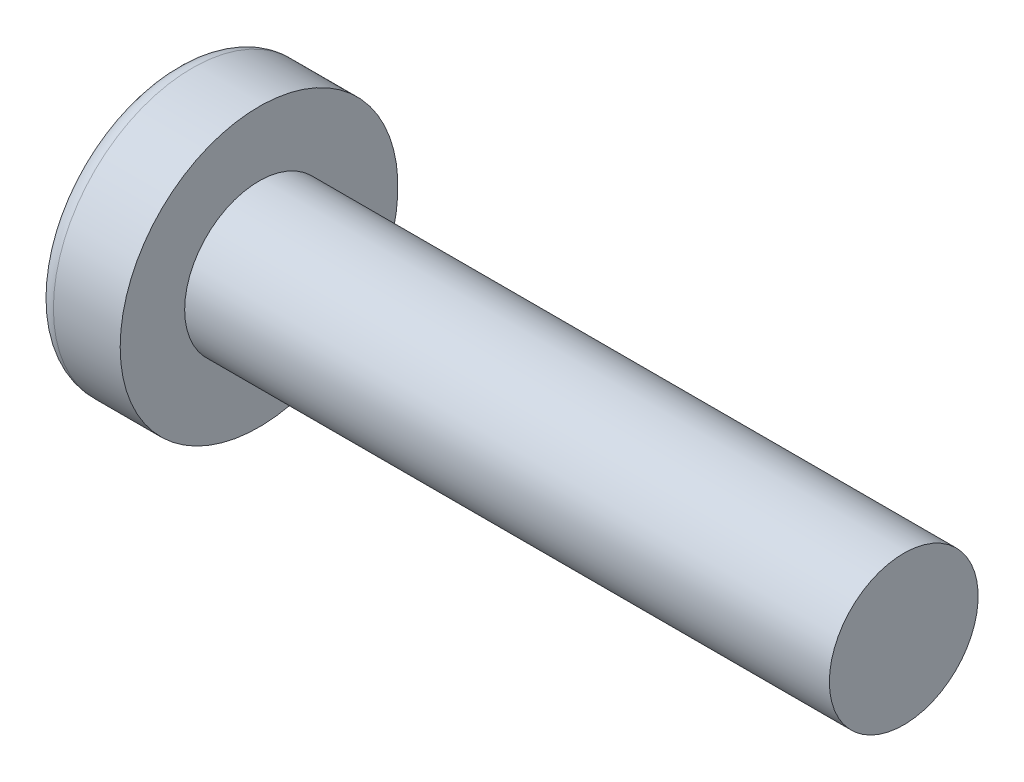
from build123d import *

# Parameters (mm, degrees)
CIRPATTERN1_COUNT = 2
CIRPATTERN1_ANGLE = 90


with BuildPart() as part:
    # BodySke → Base-Revolve (revolve)
    with BuildSketch(Plane.XY, mode=Mode.PRIVATE) as base_revolve_sk:
        with BuildLine():
            Line((2.4, 1.5), (2.4, 2.8))
            Line((2.4, 2.8), (1.053355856, 2.8))
            ThreePointArc((1.053355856, 2.8), (0.878072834, 2.754445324), (0.747150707, 2.629310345))
            ThreePointArc((0.747150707, 2.629310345), (0.190413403, 1.366702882), (0, 0))
            Line((0, 0), (15.4, 0))
            Line((15.4, 0), (15.4, 1.5))
            Line((15.4, 1.5), (2.4, 1.5))
        make_face()
    revolve(base_revolve_sk.sketch.rotate(Axis((-25.4, 0, 0), (1, 0, 0)), 90), axis=Axis((-25.4, 0, 0), (1, 0, 0)))

    # Sketch3 → Cut-Loft1 section 0
    with BuildSketch(Plane(origin=(0, 0, 0), x_dir=(0, 0, -1), z_dir=(1, 0, 0))):
        with BuildLine():
            Line((0.37, -1.45), (-0.37, -1.45))
            Line((-0.37, -1.45), (-0.37, 1.45))
            Line((-0.37, 1.45), (0.37, 1.45))
            Line((0.37, 1.45), (0.37, -1.45))
        make_face()
    # Sketch4 → Cut-Loft1 section 1
    with BuildSketch(Plane(origin=(1.76, 0, 0), x_dir=(0, 0, -1), z_dir=(1, 0, 0))):
        with BuildLine():
            Line((0.185, -0.185), (-0.185, -0.185))
            Line((-0.185, -0.185), (-0.185, 0.185))
            Line((-0.185, 0.185), (0.185, 0.185))
            Line((0.185, 0.185), (0.185, -0.185))
        make_face()
    cut_loft1 = loft(mode=Mode.SUBTRACT)

    # CirPattern1: Cut-Loft1 ×2 about axis
    cirpattern1_axis = Axis((0, 0, 0), (1, 0, 0))
    for i in range(1, CIRPATTERN1_COUNT):
        add(cut_loft1.rotate(cirpattern1_axis, i * CIRPATTERN1_ANGLE / (CIRPATTERN1_COUNT - 1)), mode=Mode.SUBTRACT)


solid = part.part
